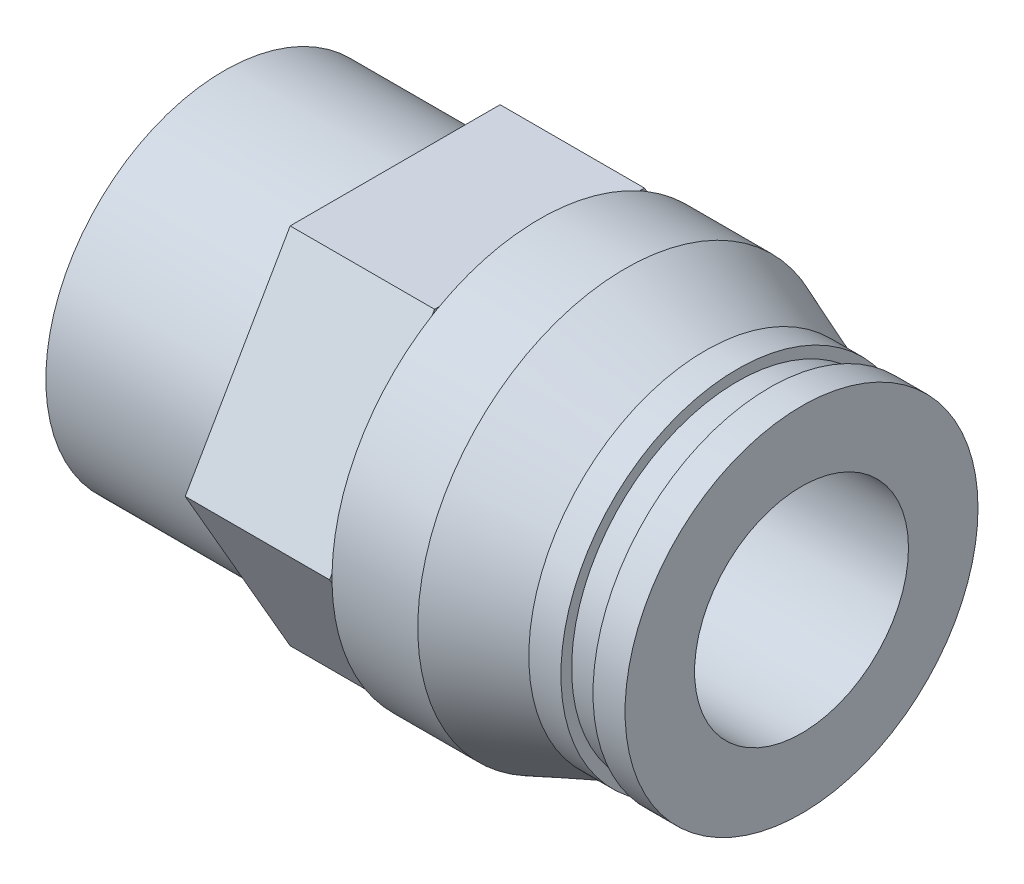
ISO-10303-21;
HEADER;
FILE_DESCRIPTION(('STEP AP214'),'2;1');
FILE_NAME('part.step','',(''),(''),'','','');
FILE_SCHEMA(('AUTOMOTIVE_DESIGN { 1 0 10303 214 1 1 1 1 }'));
ENDSEC;
DATA;
#1=APPLICATION_CONTEXT('core data for automotive mechanical design processes');
#2=APPLICATION_PROTOCOL_DEFINITION('international standard','automotive_design',2000,#1);
#3=PRODUCT_CONTEXT('',#1,'mechanical');
#4=PRODUCT('Part','Part','',(#3));
#5=PRODUCT_RELATED_PRODUCT_CATEGORY('part','',(#4));
#6=PRODUCT_DEFINITION_FORMATION('','',#4);
#7=PRODUCT_DEFINITION_CONTEXT('part definition',#1,'design');
#8=PRODUCT_DEFINITION('design','',#6,#7);
#9=PRODUCT_DEFINITION_SHAPE('','',#8);
#10=(LENGTH_UNIT() NAMED_UNIT(*) SI_UNIT(.MILLI.,.METRE.));
#11=(NAMED_UNIT(*) PLANE_ANGLE_UNIT() SI_UNIT($,.RADIAN.));
#12=(NAMED_UNIT(*) SI_UNIT($,.STERADIAN.) SOLID_ANGLE_UNIT());
#13=UNCERTAINTY_MEASURE_WITH_UNIT(LENGTH_MEASURE(1.E-05),#10,'distance_accuracy_value','');
#14=(GEOMETRIC_REPRESENTATION_CONTEXT(3) GLOBAL_UNCERTAINTY_ASSIGNED_CONTEXT((#13)) GLOBAL_UNIT_ASSIGNED_CONTEXT((#10,
#11,#12)) REPRESENTATION_CONTEXT('',''));
#15=CARTESIAN_POINT('',(0.,0.,0.));
#16=DIRECTION('',(0.,0.,1.));
#17=DIRECTION('',(1.,0.,0.));
#18=AXIS2_PLACEMENT_3D('',#15,#16,#17);
#19=CARTESIAN_POINT('',(8.,8.33,0.));
#20=DIRECTION('',(-1.,0.,0.));
#21=DIRECTION('',(0.,0.,1.));
#22=AXIS2_PLACEMENT_3D('',#19,#20,#21);
#23=PLANE('',#22);
#24=CARTESIAN_POINT('',(8.,0.,0.));
#25=DIRECTION('',(1.,0.,0.));
#26=DIRECTION('',(0.,0.,-1.));
#27=AXIS2_PLACEMENT_3D('',#24,#25,#26);
#28=CIRCLE('',#27,8.33);
#29=CARTESIAN_POINT('',(8.,0.,-8.33));
#30=VERTEX_POINT('',#29);
#31=EDGE_CURVE('E271',#30,#30,#28,.T.);
#32=ORIENTED_EDGE('',*,*,#31,.T.);
#33=EDGE_LOOP('',(#32));
#34=FACE_BOUND('',#33,.T.);
#35=DIRECTION('',(0.,-0.866025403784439,0.5));
#36=VECTOR('',#35,1.);
#37=CARTESIAN_POINT('',(8.,0.,-9.81495457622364));
#38=LINE('',#37,#36);
#39=CARTESIAN_POINT('',(8.,0.,-9.81495457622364));
#40=VERTEX_POINT('',#39);
#41=CARTESIAN_POINT('',(8.,-8.5,-4.90747728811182));
#42=VERTEX_POINT('',#41);
#43=EDGE_CURVE('E165',#40,#42,#38,.T.);
#44=ORIENTED_EDGE('',*,*,#43,.T.);
#45=DIRECTION('',(0.,0.,1.));
#46=VECTOR('',#45,1.);
#47=CARTESIAN_POINT('',(8.,-8.5,-4.90747728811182));
#48=LINE('',#47,#46);
#49=CARTESIAN_POINT('',(8.,-8.5,4.90747728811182));
#50=VERTEX_POINT('',#49);
#51=EDGE_CURVE('E147',#42,#50,#48,.T.);
#52=ORIENTED_EDGE('',*,*,#51,.T.);
#53=DIRECTION('',(0.,0.866025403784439,0.5));
#54=VECTOR('',#53,1.);
#55=CARTESIAN_POINT('',(8.,-8.5,4.90747728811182));
#56=LINE('',#55,#54);
#57=CARTESIAN_POINT('',(8.,0.,9.81495457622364));
#58=VERTEX_POINT('',#57);
#59=EDGE_CURVE('E159',#50,#58,#56,.T.);
#60=ORIENTED_EDGE('',*,*,#59,.T.);
#61=DIRECTION('',(0.,0.866025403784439,-0.5));
#62=VECTOR('',#61,1.);
#63=CARTESIAN_POINT('',(8.,0.,9.81495457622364));
#64=LINE('',#63,#62);
#65=CARTESIAN_POINT('',(8.,8.5,4.90747728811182));
#66=VERTEX_POINT('',#65);
#67=EDGE_CURVE('E31',#58,#66,#64,.T.);
#68=ORIENTED_EDGE('',*,*,#67,.T.);
#69=DIRECTION('',(0.,0.,-1.));
#70=VECTOR('',#69,1.);
#71=CARTESIAN_POINT('',(8.,8.5,4.90747728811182));
#72=LINE('',#71,#70);
#73=CARTESIAN_POINT('',(8.,8.5,-4.90747728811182));
#74=VERTEX_POINT('',#73);
#75=EDGE_CURVE('E169',#66,#74,#72,.T.);
#76=ORIENTED_EDGE('',*,*,#75,.T.);
#77=DIRECTION('',(0.,-0.866025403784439,-0.5));
#78=VECTOR('',#77,1.);
#79=CARTESIAN_POINT('',(8.,8.5,-4.90747728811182));
#80=LINE('',#79,#78);
#81=EDGE_CURVE('E172',#74,#40,#80,.T.);
#82=ORIENTED_EDGE('',*,*,#81,.T.);
#83=EDGE_LOOP('',(#44,#52,#60,#68,#76,#82));
#84=FACE_BOUND('',#83,.T.);
#85=ADVANCED_FACE('F16',(#34,#84),#23,.T.);
#86=CARTESIAN_POINT('',(14.75,10.5,0.));
#87=DIRECTION('',(1.,0.,0.));
#88=DIRECTION('',(0.,0.,-1.));
#89=AXIS2_PLACEMENT_3D('',#86,#87,#88);
#90=PLANE('',#89);
#91=CARTESIAN_POINT('',(14.75,0.,0.));
#92=DIRECTION('',(1.,0.,0.));
#93=DIRECTION('',(0.,0.,-1.));
#94=AXIS2_PLACEMENT_3D('',#91,#92,#93);
#95=CIRCLE('',#94,9.70235505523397);
#96=CARTESIAN_POINT('',(14.75,-8.5,-4.67821478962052));
#97=VERTEX_POINT('',#96);
#98=CARTESIAN_POINT('',(14.75,-8.30145285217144,-5.02210853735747));
#99=VERTEX_POINT('',#98);
#100=EDGE_CURVE('E382',#97,#99,#95,.T.);
#101=ORIENTED_EDGE('',*,*,#100,.F.);
#102=DIRECTION('',(0.,0.,1.));
#103=VECTOR('',#102,1.);
#104=CARTESIAN_POINT('',(14.75,-8.5,-4.90747728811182));
#105=LINE('',#104,#103);
#106=CARTESIAN_POINT('',(14.75,-8.5,-4.90747728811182));
#107=VERTEX_POINT('',#106);
#108=EDGE_CURVE('E175',#107,#97,#105,.T.);
#109=ORIENTED_EDGE('',*,*,#108,.F.);
#110=DIRECTION('',(0.,-0.866025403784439,0.5));
#111=VECTOR('',#110,1.);
#112=CARTESIAN_POINT('',(14.75,0.,-9.81495457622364));
#113=LINE('',#112,#111);
#114=EDGE_CURVE('E195',#99,#107,#113,.T.);
#115=ORIENTED_EDGE('',*,*,#114,.F.);
#116=EDGE_LOOP('',(#101,#109,#115));
#117=FACE_BOUND('',#116,.T.);
#118=ADVANCED_FACE('F326',(#117),#90,.T.);
#119=CARTESIAN_POINT('',(14.75,-0.198547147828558,-9.70032332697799));
#120=VERTEX_POINT('',#119);
#121=CARTESIAN_POINT('',(14.75,0.198547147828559,-9.70032332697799));
#122=VERTEX_POINT('',#121);
#123=EDGE_CURVE('E267',#120,#122,#95,.T.);
#124=ORIENTED_EDGE('',*,*,#123,.F.);
#125=CARTESIAN_POINT('',(14.75,0.,-9.81495457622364));
#126=VERTEX_POINT('',#125);
#127=EDGE_CURVE('E156',#126,#120,#113,.T.);
#128=ORIENTED_EDGE('',*,*,#127,.F.);
#129=DIRECTION('',(0.,-0.866025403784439,-0.5));
#130=VECTOR('',#129,1.);
#131=CARTESIAN_POINT('',(14.75,8.5,-4.90747728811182));
#132=LINE('',#131,#130);
#133=EDGE_CURVE('E190',#122,#126,#132,.T.);
#134=ORIENTED_EDGE('',*,*,#133,.F.);
#135=EDGE_LOOP('',(#124,#128,#134));
#136=FACE_BOUND('',#135,.T.);
#137=ADVANCED_FACE('F332',(#136),#90,.T.);
#138=CARTESIAN_POINT('',(14.75,8.30145285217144,-5.02210853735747));
#139=VERTEX_POINT('',#138);
#140=CARTESIAN_POINT('',(14.75,8.5,-4.67821478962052));
#141=VERTEX_POINT('',#140);
#142=EDGE_CURVE('E272',#139,#141,#95,.T.);
#143=ORIENTED_EDGE('',*,*,#142,.F.);
#144=CARTESIAN_POINT('',(14.75,8.5,-4.90747728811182));
#145=VERTEX_POINT('',#144);
#146=EDGE_CURVE('E192',#145,#139,#132,.T.);
#147=ORIENTED_EDGE('',*,*,#146,.F.);
#148=DIRECTION('',(0.,0.,-1.));
#149=VECTOR('',#148,1.);
#150=CARTESIAN_POINT('',(14.75,8.5,4.90747728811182));
#151=LINE('',#150,#149);
#152=EDGE_CURVE('E185',#141,#145,#151,.T.);
#153=ORIENTED_EDGE('',*,*,#152,.F.);
#154=EDGE_LOOP('',(#143,#147,#153));
#155=FACE_BOUND('',#154,.T.);
#156=ADVANCED_FACE('F444',(#155),#90,.T.);
#157=CARTESIAN_POINT('',(14.75,8.5,4.67821478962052));
#158=VERTEX_POINT('',#157);
#159=CARTESIAN_POINT('',(14.75,8.30145285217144,5.02210853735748));
#160=VERTEX_POINT('',#159);
#161=EDGE_CURVE('E379',#158,#160,#95,.T.);
#162=ORIENTED_EDGE('',*,*,#161,.F.);
#163=CARTESIAN_POINT('',(14.75,8.5,4.90747728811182));
#164=VERTEX_POINT('',#163);
#165=EDGE_CURVE('E187',#164,#158,#151,.T.);
#166=ORIENTED_EDGE('',*,*,#165,.F.);
#167=DIRECTION('',(0.,0.866025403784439,-0.5));
#168=VECTOR('',#167,1.);
#169=CARTESIAN_POINT('',(14.75,0.,9.81495457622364));
#170=LINE('',#169,#168);
#171=EDGE_CURVE('E182',#160,#164,#170,.T.);
#172=ORIENTED_EDGE('',*,*,#171,.F.);
#173=EDGE_LOOP('',(#162,#166,#172));
#174=FACE_BOUND('',#173,.T.);
#175=ADVANCED_FACE('F362',(#174),#90,.T.);
#176=CARTESIAN_POINT('',(14.75,0.198547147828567,9.70032332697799));
#177=VERTEX_POINT('',#176);
#178=CARTESIAN_POINT('',(14.75,-0.198547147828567,9.70032332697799));
#179=VERTEX_POINT('',#178);
#180=EDGE_CURVE('E373',#177,#179,#95,.T.);
#181=ORIENTED_EDGE('',*,*,#180,.F.);
#182=CARTESIAN_POINT('',(14.75,0.,9.81495457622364));
#183=VERTEX_POINT('',#182);
#184=EDGE_CURVE('E37',#183,#177,#170,.T.);
#185=ORIENTED_EDGE('',*,*,#184,.F.);
#186=DIRECTION('',(0.,0.866025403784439,0.5));
#187=VECTOR('',#186,1.);
#188=CARTESIAN_POINT('',(14.75,-8.5,4.90747728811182));
#189=LINE('',#188,#187);
#190=EDGE_CURVE('E178',#179,#183,#189,.T.);
#191=ORIENTED_EDGE('',*,*,#190,.F.);
#192=EDGE_LOOP('',(#181,#185,#191));
#193=FACE_BOUND('',#192,.T.);
#194=ADVANCED_FACE('F357',(#193),#90,.T.);
#195=CARTESIAN_POINT('',(14.75,-8.5,4.90747728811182));
#196=VERTEX_POINT('',#195);
#197=CARTESIAN_POINT('',(14.75,-8.30145285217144,5.02210853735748));
#198=VERTEX_POINT('',#197);
#199=EDGE_CURVE('E180',#196,#198,#189,.T.);
#200=ORIENTED_EDGE('',*,*,#199,.F.);
#201=CARTESIAN_POINT('',(14.75,-8.5,4.67821478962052));
#202=VERTEX_POINT('',#201);
#203=EDGE_CURVE('E151',#202,#196,#105,.T.);
#204=ORIENTED_EDGE('',*,*,#203,.F.);
#205=EDGE_CURVE('E366',#198,#202,#95,.T.);
#206=ORIENTED_EDGE('',*,*,#205,.F.);
#207=EDGE_LOOP('',(#200,#204,#206));
#208=FACE_BOUND('',#207,.T.);
#209=ADVANCED_FACE('F335',(#208),#90,.T.);
#210=CARTESIAN_POINT('',(0.,0.,0.));
#211=DIRECTION('',(-1.,0.,0.));
#212=DIRECTION('',(0.,0.,1.));
#213=AXIS2_PLACEMENT_3D('',#210,#211,#212);
#214=PLANE('',#213);
#215=CARTESIAN_POINT('',(0.,0.,0.));
#216=DIRECTION('',(1.,0.,0.));
#217=DIRECTION('',(0.,0.,-1.));
#218=AXIS2_PLACEMENT_3D('',#215,#216,#217);
#219=CIRCLE('',#218,8.33);
#220=CARTESIAN_POINT('',(0.,0.,-8.33));
#221=VERTEX_POINT('',#220);
#222=EDGE_CURVE('E275',#221,#221,#219,.T.);
#223=ORIENTED_EDGE('',*,*,#222,.F.);
#224=EDGE_LOOP('',(#223));
#225=FACE_BOUND('',#224,.T.);
#226=DIRECTION('',(0.,-0.866025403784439,-0.5));
#227=VECTOR('',#226,1.);
#228=CARTESIAN_POINT('',(0.,0.,4.618802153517));
#229=LINE('',#228,#227);
#230=CARTESIAN_POINT('',(0.,0.,4.618802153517));
#231=VERTEX_POINT('',#230);
#232=CARTESIAN_POINT('',(0.,-4.,2.3094010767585));
#233=VERTEX_POINT('',#232);
#234=EDGE_CURVE('E224',#231,#233,#229,.T.);
#235=ORIENTED_EDGE('',*,*,#234,.T.);
#236=DIRECTION('',(0.,0.,-1.));
#237=VECTOR('',#236,1.);
#238=CARTESIAN_POINT('',(0.,-4.,2.3094010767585));
#239=LINE('',#238,#237);
#240=CARTESIAN_POINT('',(0.,-4.,-2.30940107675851));
#241=VERTEX_POINT('',#240);
#242=EDGE_CURVE('E202',#233,#241,#239,.T.);
#243=ORIENTED_EDGE('',*,*,#242,.T.);
#244=DIRECTION('',(0.,0.866025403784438,-0.5));
#245=VECTOR('',#244,1.);
#246=CARTESIAN_POINT('',(0.,-4.,-2.30940107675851));
#247=LINE('',#246,#245);
#248=CARTESIAN_POINT('',(0.,0.,-4.61880215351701));
#249=VERTEX_POINT('',#248);
#250=EDGE_CURVE('E212',#241,#249,#247,.T.);
#251=ORIENTED_EDGE('',*,*,#250,.T.);
#252=DIRECTION('',(0.,0.866025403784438,0.5));
#253=VECTOR('',#252,1.);
#254=CARTESIAN_POINT('',(0.,0.,-4.61880215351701));
#255=LINE('',#254,#253);
#256=CARTESIAN_POINT('',(0.,4.,-2.3094010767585));
#257=VERTEX_POINT('',#256);
#258=EDGE_CURVE('E215',#249,#257,#255,.T.);
#259=ORIENTED_EDGE('',*,*,#258,.T.);
#260=DIRECTION('',(0.,0.,1.));
#261=VECTOR('',#260,1.);
#262=CARTESIAN_POINT('',(0.,4.,-2.3094010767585));
#263=LINE('',#262,#261);
#264=CARTESIAN_POINT('',(0.,4.,2.3094010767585));
#265=VERTEX_POINT('',#264);
#266=EDGE_CURVE('E218',#257,#265,#263,.T.);
#267=ORIENTED_EDGE('',*,*,#266,.T.);
#268=DIRECTION('',(0.,-0.866025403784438,0.5));
#269=VECTOR('',#268,1.);
#270=CARTESIAN_POINT('',(0.,4.,2.3094010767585));
#271=LINE('',#270,#269);
#272=EDGE_CURVE('E221',#265,#231,#271,.T.);
#273=ORIENTED_EDGE('',*,*,#272,.T.);
#274=EDGE_LOOP('',(#235,#243,#251,#259,#267,#273));
#275=FACE_BOUND('',#274,.T.);
#276=ADVANCED_FACE('F18',(#225,#275),#214,.T.);
#277=CARTESIAN_POINT('',(8.5,5.,0.));
#278=DIRECTION('',(1.,0.,0.));
#279=DIRECTION('',(0.,0.,-1.));
#280=AXIS2_PLACEMENT_3D('',#277,#278,#279);
#281=PLANE('',#280);
#282=CARTESIAN_POINT('',(8.5,0.,0.));
#283=DIRECTION('',(1.,0.,0.));
#284=DIRECTION('',(0.,0.,-1.));
#285=AXIS2_PLACEMENT_3D('',#282,#283,#284);
#286=CIRCLE('',#285,5.);
#287=CARTESIAN_POINT('',(8.5,0.,-5.));
#288=VERTEX_POINT('',#287);
#289=EDGE_CURVE('E240',#288,#288,#286,.T.);
#290=ORIENTED_EDGE('',*,*,#289,.T.);
#291=EDGE_LOOP('',(#290));
#292=FACE_BOUND('',#291,.T.);
#293=DIRECTION('',(0.,-0.866025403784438,0.5));
#294=VECTOR('',#293,1.);
#295=CARTESIAN_POINT('',(8.5,1.75,-5.62916512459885));
#296=LINE('',#295,#294);
#297=CARTESIAN_POINT('',(8.5,0.,-4.61880215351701));
#298=VERTEX_POINT('',#297);
#299=CARTESIAN_POINT('',(8.5,-4.,-2.30940107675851));
#300=VERTEX_POINT('',#299);
#301=EDGE_CURVE('E24',#298,#300,#296,.T.);
#302=ORIENTED_EDGE('',*,*,#301,.T.);
#303=DIRECTION('',(0.,0.,1.));
#304=VECTOR('',#303,1.);
#305=CARTESIAN_POINT('',(8.5,-4.,0.));
#306=LINE('',#305,#304);
#307=CARTESIAN_POINT('',(8.5,-4.,2.3094010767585));
#308=VERTEX_POINT('',#307);
#309=EDGE_CURVE('E10',#300,#308,#306,.T.);
#310=ORIENTED_EDGE('',*,*,#309,.T.);
#311=DIRECTION('',(0.,0.866025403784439,0.5));
#312=VECTOR('',#311,1.);
#313=CARTESIAN_POINT('',(8.5,1.75,5.62916512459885));
#314=LINE('',#313,#312);
#315=CARTESIAN_POINT('',(8.5,0.,4.618802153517));
#316=VERTEX_POINT('',#315);
#317=EDGE_CURVE('E278',#308,#316,#314,.T.);
#318=ORIENTED_EDGE('',*,*,#317,.T.);
#319=DIRECTION('',(0.,0.866025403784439,-0.5));
#320=VECTOR('',#319,1.);
#321=CARTESIAN_POINT('',(8.5,5.75,1.29903810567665));
#322=LINE('',#321,#320);
#323=CARTESIAN_POINT('',(8.5,4.,2.3094010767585));
#324=VERTEX_POINT('',#323);
#325=EDGE_CURVE('E281',#316,#324,#322,.T.);
#326=ORIENTED_EDGE('',*,*,#325,.T.);
#327=DIRECTION('',(0.,0.,-1.));
#328=VECTOR('',#327,1.);
#329=CARTESIAN_POINT('',(8.5,4.,0.));
#330=LINE('',#329,#328);
#331=CARTESIAN_POINT('',(8.5,4.,-2.3094010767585));
#332=VERTEX_POINT('',#331);
#333=EDGE_CURVE('E284',#324,#332,#330,.T.);
#334=ORIENTED_EDGE('',*,*,#333,.T.);
#335=DIRECTION('',(0.,-0.866025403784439,-0.5));
#336=VECTOR('',#335,1.);
#337=CARTESIAN_POINT('',(8.5,5.75,-1.29903810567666));
#338=LINE('',#337,#336);
#339=EDGE_CURVE('E287',#332,#298,#338,.T.);
#340=ORIENTED_EDGE('',*,*,#339,.T.);
#341=EDGE_LOOP('',(#302,#310,#318,#326,#334,#340));
#342=FACE_BOUND('',#341,.T.);
#343=ADVANCED_FACE('F291',(#292,#342),#281,.T.);
#344=CARTESIAN_POINT('',(0.,0.,0.));
#345=DIRECTION('',(1.,0.,0.));
#346=DIRECTION('',(0.,0.,-1.));
#347=AXIS2_PLACEMENT_3D('',#344,#345,#346);
#348=CYLINDRICAL_SURFACE('',#347,8.33);
#349=ORIENTED_EDGE('',*,*,#222,.T.);
#350=EDGE_LOOP('',(#349));
#351=FACE_BOUND('',#350,.T.);
#352=ORIENTED_EDGE('',*,*,#31,.F.);
#353=EDGE_LOOP('',(#352));
#354=FACE_BOUND('',#353,.T.);
#355=ADVANCED_FACE('F337',(#351,#354),#348,.T.);
#356=CARTESIAN_POINT('',(0.,0.,0.));
#357=DIRECTION('',(1.,0.,0.));
#358=DIRECTION('',(0.,0.,-1.));
#359=AXIS2_PLACEMENT_3D('',#356,#357,#358);
#360=CYLINDRICAL_SURFACE('',#359,9.70235505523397);
#361=EDGE_CURVE('E268',#122,#139,#95,.T.);
#362=ORIENTED_EDGE('',*,*,#361,.T.);
#363=ORIENTED_EDGE('',*,*,#142,.T.);
#364=EDGE_CURVE('E446',#141,#158,#95,.T.);
#365=ORIENTED_EDGE('',*,*,#364,.T.);
#366=ORIENTED_EDGE('',*,*,#161,.T.);
#367=EDGE_CURVE('E378',#160,#177,#95,.T.);
#368=ORIENTED_EDGE('',*,*,#367,.T.);
#369=ORIENTED_EDGE('',*,*,#180,.T.);
#370=EDGE_CURVE('E376',#179,#198,#95,.T.);
#371=ORIENTED_EDGE('',*,*,#370,.T.);
#372=ORIENTED_EDGE('',*,*,#205,.T.);
#373=EDGE_CURVE('E380',#202,#97,#95,.T.);
#374=ORIENTED_EDGE('',*,*,#373,.T.);
#375=ORIENTED_EDGE('',*,*,#100,.T.);
#376=EDGE_CURVE('E384',#99,#120,#95,.T.);
#377=ORIENTED_EDGE('',*,*,#376,.T.);
#378=ORIENTED_EDGE('',*,*,#123,.T.);
#379=EDGE_LOOP('',(#362,#363,#365,#366,#368,#369,#371,#372,#374,#375,#377,#378));
#380=FACE_BOUND('',#379,.T.);
#381=CARTESIAN_POINT('',(18.7610861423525,0.,0.));
#382=DIRECTION('',(1.,0.,0.));
#383=DIRECTION('',(0.,0.,-1.));
#384=AXIS2_PLACEMENT_3D('',#381,#382,#383);
#385=CIRCLE('',#384,9.70235505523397);
#386=CARTESIAN_POINT('',(18.7610861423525,0.,-9.70235505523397));
#387=VERTEX_POINT('',#386);
#388=EDGE_CURVE('E264',#387,#387,#385,.T.);
#389=ORIENTED_EDGE('',*,*,#388,.F.);
#390=EDGE_LOOP('',(#389));
#391=FACE_BOUND('',#390,.T.);
#392=ADVANCED_FACE('F339',(#380,#391),#360,.T.);
#393=CARTESIAN_POINT('',(22.5,0.,0.));
#394=DIRECTION('',(-1.,0.,0.));
#395=DIRECTION('',(0.,0.,1.));
#396=AXIS2_PLACEMENT_3D('',#393,#394,#395);
#397=CONICAL_SURFACE('',#396,8.25,0.370503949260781);
#398=ORIENTED_EDGE('',*,*,#388,.T.);
#399=EDGE_LOOP('',(#398));
#400=FACE_BOUND('',#399,.T.);
#401=CARTESIAN_POINT('',(22.5,0.,0.));
#402=DIRECTION('',(1.,0.,0.));
#403=DIRECTION('',(0.,0.,-1.));
#404=AXIS2_PLACEMENT_3D('',#401,#402,#403);
#405=CIRCLE('',#404,8.25);
#406=CARTESIAN_POINT('',(22.5,0.,-8.25));
#407=VERTEX_POINT('',#406);
#408=EDGE_CURVE('E261',#407,#407,#405,.T.);
#409=ORIENTED_EDGE('',*,*,#408,.F.);
#410=EDGE_LOOP('',(#409));
#411=FACE_BOUND('',#410,.T.);
#412=ADVANCED_FACE('F345',(#400,#411),#397,.T.);
#413=CARTESIAN_POINT('',(0.,0.,0.));
#414=DIRECTION('',(1.,0.,0.));
#415=DIRECTION('',(0.,0.,-1.));
#416=AXIS2_PLACEMENT_3D('',#413,#414,#415);
#417=CYLINDRICAL_SURFACE('',#416,8.25);
#418=ORIENTED_EDGE('',*,*,#408,.T.);
#419=EDGE_LOOP('',(#418));
#420=FACE_BOUND('',#419,.T.);
#421=CARTESIAN_POINT('',(24.,0.,0.));
#422=DIRECTION('',(1.,0.,0.));
#423=DIRECTION('',(0.,0.,-1.));
#424=AXIS2_PLACEMENT_3D('',#421,#422,#423);
#425=CIRCLE('',#424,8.25);
#426=CARTESIAN_POINT('',(24.,0.,-8.25));
#427=VERTEX_POINT('',#426);
#428=EDGE_CURVE('E258',#427,#427,#425,.T.);
#429=ORIENTED_EDGE('',*,*,#428,.F.);
#430=EDGE_LOOP('',(#429));
#431=FACE_BOUND('',#430,.T.);
#432=ADVANCED_FACE('F607',(#420,#431),#417,.T.);
#433=CARTESIAN_POINT('',(24.,8.25,0.));
#434=DIRECTION('',(1.,0.,0.));
#435=DIRECTION('',(0.,0.,-1.));
#436=AXIS2_PLACEMENT_3D('',#433,#434,#435);
#437=PLANE('',#436);
#438=ORIENTED_EDGE('',*,*,#428,.T.);
#439=EDGE_LOOP('',(#438));
#440=FACE_BOUND('',#439,.T.);
#441=CARTESIAN_POINT('',(24.,0.,0.));
#442=DIRECTION('',(1.,0.,0.));
#443=DIRECTION('',(0.,0.,-1.));
#444=AXIS2_PLACEMENT_3D('',#441,#442,#443);
#445=CIRCLE('',#444,7.75);
#446=CARTESIAN_POINT('',(24.,0.,-7.75));
#447=VERTEX_POINT('',#446);
#448=EDGE_CURVE('E255',#447,#447,#445,.T.);
#449=ORIENTED_EDGE('',*,*,#448,.F.);
#450=EDGE_LOOP('',(#449));
#451=FACE_BOUND('',#450,.T.);
#452=ADVANCED_FACE('F597',(#440,#451),#437,.T.);
#453=CARTESIAN_POINT('',(0.,0.,0.));
#454=DIRECTION('',(1.,0.,0.));
#455=DIRECTION('',(0.,0.,-1.));
#456=AXIS2_PLACEMENT_3D('',#453,#454,#455);
#457=CYLINDRICAL_SURFACE('',#456,7.75);
#458=ORIENTED_EDGE('',*,*,#448,.T.);
#459=EDGE_LOOP('',(#458));
#460=FACE_BOUND('',#459,.T.);
#461=CARTESIAN_POINT('',(25.5,0.,0.));
#462=DIRECTION('',(1.,0.,0.));
#463=DIRECTION('',(0.,0.,-1.));
#464=AXIS2_PLACEMENT_3D('',#461,#462,#463);
#465=CIRCLE('',#464,7.75);
#466=CARTESIAN_POINT('',(25.5,0.,-7.75));
#467=VERTEX_POINT('',#466);
#468=EDGE_CURVE('E252',#467,#467,#465,.T.);
#469=ORIENTED_EDGE('',*,*,#468,.F.);
#470=EDGE_LOOP('',(#469));
#471=FACE_BOUND('',#470,.T.);
#472=ADVANCED_FACE('F587',(#460,#471),#457,.T.);
#473=CARTESIAN_POINT('',(25.5,7.75,0.));
#474=DIRECTION('',(-1.,0.,0.));
#475=DIRECTION('',(0.,0.,1.));
#476=AXIS2_PLACEMENT_3D('',#473,#474,#475);
#477=PLANE('',#476);
#478=ORIENTED_EDGE('',*,*,#468,.T.);
#479=EDGE_LOOP('',(#478));
#480=FACE_BOUND('',#479,.T.);
#481=CARTESIAN_POINT('',(25.5,0.,0.));
#482=DIRECTION('',(1.,0.,0.));
#483=DIRECTION('',(0.,0.,-1.));
#484=AXIS2_PLACEMENT_3D('',#481,#482,#483);
#485=CIRCLE('',#484,8.25);
#486=CARTESIAN_POINT('',(25.5,0.,-8.25));
#487=VERTEX_POINT('',#486);
#488=EDGE_CURVE('E249',#487,#487,#485,.T.);
#489=ORIENTED_EDGE('',*,*,#488,.F.);
#490=EDGE_LOOP('',(#489));
#491=FACE_BOUND('',#490,.T.);
#492=ADVANCED_FACE('F575',(#480,#491),#477,.T.);
#493=CARTESIAN_POINT('',(0.,0.,0.));
#494=DIRECTION('',(1.,0.,0.));
#495=DIRECTION('',(0.,0.,-1.));
#496=AXIS2_PLACEMENT_3D('',#493,#494,#495);
#497=CYLINDRICAL_SURFACE('',#496,8.25);
#498=ORIENTED_EDGE('',*,*,#488,.T.);
#499=EDGE_LOOP('',(#498));
#500=FACE_BOUND('',#499,.T.);
#501=CARTESIAN_POINT('',(27.,0.,0.));
#502=DIRECTION('',(1.,0.,0.));
#503=DIRECTION('',(0.,0.,-1.));
#504=AXIS2_PLACEMENT_3D('',#501,#502,#503);
#505=CIRCLE('',#504,8.25);
#506=CARTESIAN_POINT('',(27.,0.,-8.25));
#507=VERTEX_POINT('',#506);
#508=EDGE_CURVE('E246',#507,#507,#505,.T.);
#509=ORIENTED_EDGE('',*,*,#508,.F.);
#510=EDGE_LOOP('',(#509));
#511=FACE_BOUND('',#510,.T.);
#512=ADVANCED_FACE('F565',(#500,#511),#497,.T.);
#513=CARTESIAN_POINT('',(27.,8.25,0.));
#514=DIRECTION('',(1.,0.,0.));
#515=DIRECTION('',(0.,0.,-1.));
#516=AXIS2_PLACEMENT_3D('',#513,#514,#515);
#517=PLANE('',#516);
#518=ORIENTED_EDGE('',*,*,#508,.T.);
#519=EDGE_LOOP('',(#518));
#520=FACE_BOUND('',#519,.T.);
#521=CARTESIAN_POINT('',(27.,0.,0.));
#522=DIRECTION('',(1.,0.,0.));
#523=DIRECTION('',(0.,0.,-1.));
#524=AXIS2_PLACEMENT_3D('',#521,#522,#523);
#525=CIRCLE('',#524,5.);
#526=CARTESIAN_POINT('',(27.,0.,-5.));
#527=VERTEX_POINT('',#526);
#528=EDGE_CURVE('E243',#527,#527,#525,.T.);
#529=ORIENTED_EDGE('',*,*,#528,.F.);
#530=EDGE_LOOP('',(#529));
#531=FACE_BOUND('',#530,.T.);
#532=ADVANCED_FACE('F552',(#520,#531),#517,.T.);
#533=CARTESIAN_POINT('',(0.,0.,0.));
#534=DIRECTION('',(1.,0.,0.));
#535=DIRECTION('',(0.,0.,-1.));
#536=AXIS2_PLACEMENT_3D('',#533,#534,#535);
#537=CYLINDRICAL_SURFACE('',#536,5.);
#538=ORIENTED_EDGE('',*,*,#528,.T.);
#539=EDGE_LOOP('',(#538));
#540=FACE_BOUND('',#539,.T.);
#541=ORIENTED_EDGE('',*,*,#289,.F.);
#542=EDGE_LOOP('',(#541));
#543=FACE_BOUND('',#542,.T.);
#544=ADVANCED_FACE('F542',(#540,#543),#537,.F.);
#545=CARTESIAN_POINT('',(27.,-4.,2.3094010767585));
#546=DIRECTION('',(0.,1.,0.));
#547=DIRECTION('',(0.,0.,1.));
#548=AXIS2_PLACEMENT_3D('',#545,#546,#547);
#549=PLANE('',#548);
#550=DIRECTION('',(-1.,0.,0.));
#551=VECTOR('',#550,1.);
#552=CARTESIAN_POINT('',(27.,-4.,-2.30940107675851));
#553=LINE('',#552,#551);
#554=EDGE_CURVE('E238',#300,#241,#553,.T.);
#555=ORIENTED_EDGE('',*,*,#554,.T.);
#556=ORIENTED_EDGE('',*,*,#242,.F.);
#557=DIRECTION('',(-1.,0.,0.));
#558=VECTOR('',#557,1.);
#559=CARTESIAN_POINT('',(27.,-4.,2.3094010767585));
#560=LINE('',#559,#558);
#561=EDGE_CURVE('E227',#308,#233,#560,.T.);
#562=ORIENTED_EDGE('',*,*,#561,.F.);
#563=ORIENTED_EDGE('',*,*,#309,.F.);
#564=EDGE_LOOP('',(#555,#556,#562,#563));
#565=FACE_BOUND('',#564,.T.);
#566=ADVANCED_FACE('F306',(#565),#549,.T.);
#567=CARTESIAN_POINT('',(27.,-4.,-2.30940107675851));
#568=DIRECTION('',(0.,0.5,0.866025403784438));
#569=DIRECTION('',(0.,-0.866025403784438,0.5));
#570=AXIS2_PLACEMENT_3D('',#567,#568,#569);
#571=PLANE('',#570);
#572=DIRECTION('',(-1.,0.,0.));
#573=VECTOR('',#572,1.);
#574=CARTESIAN_POINT('',(27.,0.,-4.61880215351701));
#575=LINE('',#574,#573);
#576=EDGE_CURVE('E236',#298,#249,#575,.T.);
#577=ORIENTED_EDGE('',*,*,#576,.T.);
#578=ORIENTED_EDGE('',*,*,#250,.F.);
#579=ORIENTED_EDGE('',*,*,#554,.F.);
#580=ORIENTED_EDGE('',*,*,#301,.F.);
#581=EDGE_LOOP('',(#577,#578,#579,#580));
#582=FACE_BOUND('',#581,.T.);
#583=ADVANCED_FACE('F295',(#582),#571,.T.);
#584=CARTESIAN_POINT('',(27.,0.,-4.61880215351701));
#585=DIRECTION('',(0.,-0.5,0.866025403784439));
#586=DIRECTION('',(0.,-0.866025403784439,-0.5));
#587=AXIS2_PLACEMENT_3D('',#584,#585,#586);
#588=PLANE('',#587);
#589=DIRECTION('',(-1.,0.,0.));
#590=VECTOR('',#589,1.);
#591=CARTESIAN_POINT('',(27.,4.,-2.3094010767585));
#592=LINE('',#591,#590);
#593=EDGE_CURVE('E234',#332,#257,#592,.T.);
#594=ORIENTED_EDGE('',*,*,#593,.T.);
#595=ORIENTED_EDGE('',*,*,#258,.F.);
#596=ORIENTED_EDGE('',*,*,#576,.F.);
#597=ORIENTED_EDGE('',*,*,#339,.F.);
#598=EDGE_LOOP('',(#594,#595,#596,#597));
#599=FACE_BOUND('',#598,.T.);
#600=ADVANCED_FACE('F299',(#599),#588,.T.);
#601=CARTESIAN_POINT('',(27.,4.,-2.3094010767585));
#602=DIRECTION('',(0.,-1.,0.));
#603=DIRECTION('',(0.,0.,-1.));
#604=AXIS2_PLACEMENT_3D('',#601,#602,#603);
#605=PLANE('',#604);
#606=DIRECTION('',(-1.,0.,0.));
#607=VECTOR('',#606,1.);
#608=CARTESIAN_POINT('',(27.,4.,2.3094010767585));
#609=LINE('',#608,#607);
#610=EDGE_CURVE('E232',#324,#265,#609,.T.);
#611=ORIENTED_EDGE('',*,*,#610,.T.);
#612=ORIENTED_EDGE('',*,*,#266,.F.);
#613=ORIENTED_EDGE('',*,*,#593,.F.);
#614=ORIENTED_EDGE('',*,*,#333,.F.);
#615=EDGE_LOOP('',(#611,#612,#613,#614));
#616=FACE_BOUND('',#615,.T.);
#617=ADVANCED_FACE('F315',(#616),#605,.T.);
#618=CARTESIAN_POINT('',(27.,4.,2.3094010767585));
#619=DIRECTION('',(0.,-0.5,-0.866025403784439));
#620=DIRECTION('',(0.,0.866025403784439,-0.5));
#621=AXIS2_PLACEMENT_3D('',#618,#619,#620);
#622=PLANE('',#621);
#623=DIRECTION('',(-1.,0.,0.));
#624=VECTOR('',#623,1.);
#625=CARTESIAN_POINT('',(27.,0.,4.618802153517));
#626=LINE('',#625,#624);
#627=EDGE_CURVE('E230',#316,#231,#626,.T.);
#628=ORIENTED_EDGE('',*,*,#627,.T.);
#629=ORIENTED_EDGE('',*,*,#272,.F.);
#630=ORIENTED_EDGE('',*,*,#610,.F.);
#631=ORIENTED_EDGE('',*,*,#325,.F.);
#632=EDGE_LOOP('',(#628,#629,#630,#631));
#633=FACE_BOUND('',#632,.T.);
#634=ADVANCED_FACE('F312',(#633),#622,.T.);
#635=CARTESIAN_POINT('',(27.,0.,4.618802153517));
#636=DIRECTION('',(0.,0.5,-0.866025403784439));
#637=DIRECTION('',(0.,0.866025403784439,0.5));
#638=AXIS2_PLACEMENT_3D('',#635,#636,#637);
#639=PLANE('',#638);
#640=ORIENTED_EDGE('',*,*,#561,.T.);
#641=ORIENTED_EDGE('',*,*,#234,.F.);
#642=ORIENTED_EDGE('',*,*,#627,.F.);
#643=ORIENTED_EDGE('',*,*,#317,.F.);
#644=EDGE_LOOP('',(#640,#641,#642,#643));
#645=FACE_BOUND('',#644,.T.);
#646=ADVANCED_FACE('F308',(#645),#639,.T.);
#647=CARTESIAN_POINT('',(14.75,0.,0.));
#648=DIRECTION('',(-1.,0.,0.));
#649=DIRECTION('',(0.,0.,1.));
#650=AXIS2_PLACEMENT_3D('',#647,#648,#649);
#651=PLANE('',#650);
#652=EDGE_CURVE('E183',#198,#179,#189,.T.);
#653=ORIENTED_EDGE('',*,*,#652,.F.);
#654=ORIENTED_EDGE('',*,*,#370,.F.);
#655=EDGE_LOOP('',(#653,#654));
#656=FACE_BOUND('',#655,.T.);
#657=ADVANCED_FACE('F418',(#656),#651,.T.);
#658=EDGE_CURVE('E179',#97,#202,#105,.T.);
#659=ORIENTED_EDGE('',*,*,#658,.F.);
#660=ORIENTED_EDGE('',*,*,#373,.F.);
#661=EDGE_LOOP('',(#659,#660));
#662=FACE_BOUND('',#661,.T.);
#663=ADVANCED_FACE('F412',(#662),#651,.T.);
#664=EDGE_CURVE('E199',#120,#99,#113,.T.);
#665=ORIENTED_EDGE('',*,*,#664,.F.);
#666=ORIENTED_EDGE('',*,*,#376,.F.);
#667=EDGE_LOOP('',(#665,#666));
#668=FACE_BOUND('',#667,.T.);
#669=ADVANCED_FACE('F404',(#668),#651,.T.);
#670=EDGE_CURVE('E196',#139,#122,#132,.T.);
#671=ORIENTED_EDGE('',*,*,#670,.F.);
#672=ORIENTED_EDGE('',*,*,#361,.F.);
#673=EDGE_LOOP('',(#671,#672));
#674=FACE_BOUND('',#673,.T.);
#675=ADVANCED_FACE('F401',(#674),#651,.T.);
#676=EDGE_CURVE('E191',#158,#141,#151,.T.);
#677=ORIENTED_EDGE('',*,*,#676,.F.);
#678=ORIENTED_EDGE('',*,*,#364,.F.);
#679=EDGE_LOOP('',(#677,#678));
#680=FACE_BOUND('',#679,.T.);
#681=ADVANCED_FACE('F403',(#680),#651,.T.);
#682=EDGE_CURVE('E186',#177,#160,#170,.T.);
#683=ORIENTED_EDGE('',*,*,#682,.F.);
#684=ORIENTED_EDGE('',*,*,#367,.F.);
#685=EDGE_LOOP('',(#683,#684));
#686=FACE_BOUND('',#685,.T.);
#687=ADVANCED_FACE('F410',(#686),#651,.T.);
#688=CARTESIAN_POINT('',(14.75,-8.5,-4.90747728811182));
#689=DIRECTION('',(0.,-1.,0.));
#690=DIRECTION('',(0.,0.,-1.));
#691=AXIS2_PLACEMENT_3D('',#688,#689,#690);
#692=PLANE('',#691);
#693=DIRECTION('',(-1.,0.,0.));
#694=VECTOR('',#693,1.);
#695=CARTESIAN_POINT('',(14.75,-8.5,-4.90747728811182));
#696=LINE('',#695,#694);
#697=EDGE_CURVE('E200',#107,#42,#696,.T.);
#698=ORIENTED_EDGE('',*,*,#697,.F.);
#699=ORIENTED_EDGE('',*,*,#108,.T.);
#700=ORIENTED_EDGE('',*,*,#658,.T.);
#701=ORIENTED_EDGE('',*,*,#203,.T.);
#702=DIRECTION('',(-1.,0.,0.));
#703=VECTOR('',#702,1.);
#704=CARTESIAN_POINT('',(14.75,-8.5,4.90747728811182));
#705=LINE('',#704,#703);
#706=EDGE_CURVE('E142',#196,#50,#705,.T.);
#707=ORIENTED_EDGE('',*,*,#706,.T.);
#708=ORIENTED_EDGE('',*,*,#51,.F.);
#709=EDGE_LOOP('',(#698,#699,#700,#701,#707,#708));
#710=FACE_BOUND('',#709,.T.);
#711=ADVANCED_FACE('F145',(#710),#692,.T.);
#712=CARTESIAN_POINT('',(14.75,0.,-9.81495457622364));
#713=DIRECTION('',(0.,-0.5,-0.866025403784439));
#714=DIRECTION('',(0.,0.866025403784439,-0.5));
#715=AXIS2_PLACEMENT_3D('',#712,#713,#714);
#716=PLANE('',#715);
#717=DIRECTION('',(-1.,0.,0.));
#718=VECTOR('',#717,1.);
#719=CARTESIAN_POINT('',(14.75,0.,-9.81495457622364));
#720=LINE('',#719,#718);
#721=EDGE_CURVE('E203',#126,#40,#720,.T.);
#722=ORIENTED_EDGE('',*,*,#721,.F.);
#723=ORIENTED_EDGE('',*,*,#127,.T.);
#724=ORIENTED_EDGE('',*,*,#664,.T.);
#725=ORIENTED_EDGE('',*,*,#114,.T.);
#726=ORIENTED_EDGE('',*,*,#697,.T.);
#727=ORIENTED_EDGE('',*,*,#43,.F.);
#728=EDGE_LOOP('',(#722,#723,#724,#725,#726,#727));
#729=FACE_BOUND('',#728,.T.);
#730=ADVANCED_FACE('F434',(#729),#716,.T.);
#731=CARTESIAN_POINT('',(14.75,8.5,-4.90747728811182));
#732=DIRECTION('',(0.,0.5,-0.866025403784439));
#733=DIRECTION('',(0.,0.866025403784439,0.5));
#734=AXIS2_PLACEMENT_3D('',#731,#732,#733);
#735=PLANE('',#734);
#736=DIRECTION('',(-1.,0.,0.));
#737=VECTOR('',#736,1.);
#738=CARTESIAN_POINT('',(14.75,8.5,-4.90747728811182));
#739=LINE('',#738,#737);
#740=EDGE_CURVE('E205',#145,#74,#739,.T.);
#741=ORIENTED_EDGE('',*,*,#740,.F.);
#742=ORIENTED_EDGE('',*,*,#146,.T.);
#743=ORIENTED_EDGE('',*,*,#670,.T.);
#744=ORIENTED_EDGE('',*,*,#133,.T.);
#745=ORIENTED_EDGE('',*,*,#721,.T.);
#746=ORIENTED_EDGE('',*,*,#81,.F.);
#747=EDGE_LOOP('',(#741,#742,#743,#744,#745,#746));
#748=FACE_BOUND('',#747,.T.);
#749=ADVANCED_FACE('F397',(#748),#735,.T.);
#750=CARTESIAN_POINT('',(14.75,8.5,4.90747728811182));
#751=DIRECTION('',(0.,1.,0.));
#752=DIRECTION('',(0.,0.,1.));
#753=AXIS2_PLACEMENT_3D('',#750,#751,#752);
#754=PLANE('',#753);
#755=DIRECTION('',(-1.,0.,0.));
#756=VECTOR('',#755,1.);
#757=CARTESIAN_POINT('',(14.75,8.5,4.90747728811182));
#758=LINE('',#757,#756);
#759=EDGE_CURVE('E207',#164,#66,#758,.T.);
#760=ORIENTED_EDGE('',*,*,#759,.F.);
#761=ORIENTED_EDGE('',*,*,#165,.T.);
#762=ORIENTED_EDGE('',*,*,#676,.T.);
#763=ORIENTED_EDGE('',*,*,#152,.T.);
#764=ORIENTED_EDGE('',*,*,#740,.T.);
#765=ORIENTED_EDGE('',*,*,#75,.F.);
#766=EDGE_LOOP('',(#760,#761,#762,#763,#764,#765));
#767=FACE_BOUND('',#766,.T.);
#768=ADVANCED_FACE('F439',(#767),#754,.T.);
#769=CARTESIAN_POINT('',(14.75,0.,9.81495457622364));
#770=DIRECTION('',(0.,0.5,0.866025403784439));
#771=DIRECTION('',(0.,-0.866025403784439,0.5));
#772=AXIS2_PLACEMENT_3D('',#769,#770,#771);
#773=PLANE('',#772);
#774=DIRECTION('',(-1.,0.,0.));
#775=VECTOR('',#774,1.);
#776=CARTESIAN_POINT('',(14.75,0.,9.81495457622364));
#777=LINE('',#776,#775);
#778=EDGE_CURVE('E155',#183,#58,#777,.T.);
#779=ORIENTED_EDGE('',*,*,#778,.F.);
#780=ORIENTED_EDGE('',*,*,#184,.T.);
#781=ORIENTED_EDGE('',*,*,#682,.T.);
#782=ORIENTED_EDGE('',*,*,#171,.T.);
#783=ORIENTED_EDGE('',*,*,#759,.T.);
#784=ORIENTED_EDGE('',*,*,#67,.F.);
#785=EDGE_LOOP('',(#779,#780,#781,#782,#783,#784));
#786=FACE_BOUND('',#785,.T.);
#787=ADVANCED_FACE('F450',(#786),#773,.T.);
#788=CARTESIAN_POINT('',(14.75,-8.5,4.90747728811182));
#789=DIRECTION('',(0.,-0.5,0.866025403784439));
#790=DIRECTION('',(0.,-0.866025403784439,-0.5));
#791=AXIS2_PLACEMENT_3D('',#788,#789,#790);
#792=PLANE('',#791);
#793=ORIENTED_EDGE('',*,*,#706,.F.);
#794=ORIENTED_EDGE('',*,*,#199,.T.);
#795=ORIENTED_EDGE('',*,*,#652,.T.);
#796=ORIENTED_EDGE('',*,*,#190,.T.);
#797=ORIENTED_EDGE('',*,*,#778,.T.);
#798=ORIENTED_EDGE('',*,*,#59,.F.);
#799=EDGE_LOOP('',(#793,#794,#795,#796,#797,#798));
#800=FACE_BOUND('',#799,.T.);
#801=ADVANCED_FACE('F160',(#800),#792,.T.);
#802=CLOSED_SHELL('',(#85,#118,#137,#156,#175,#194,#209,#276,#343,#355,#392,#412,#432,#452,#472,
#492,#512,#532,#544,#566,#583,#600,#617,#634,#646,#657,#663,#669,#675,#681,#687,#711,#730,#749,
#768,#787,#801));
#803=MANIFOLD_SOLID_BREP('B1',#802);
#804=ADVANCED_BREP_SHAPE_REPRESENTATION('',(#18,#803),#14);
#805=SHAPE_DEFINITION_REPRESENTATION(#9,#804);
ENDSEC;
END-ISO-10303-21;
